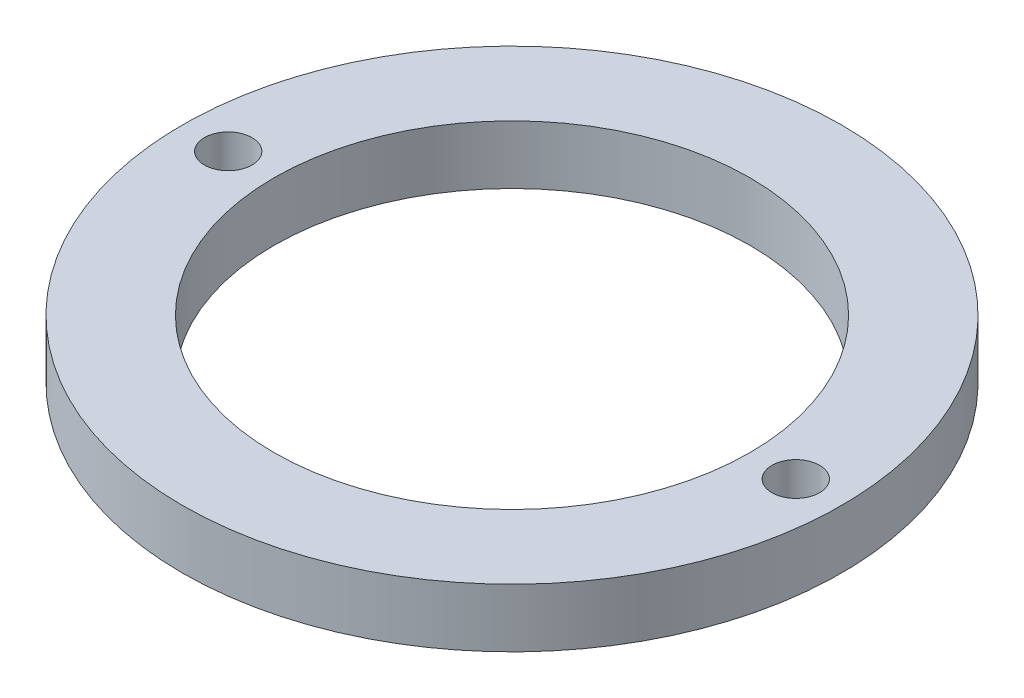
ISO-10303-21;
HEADER;
FILE_DESCRIPTION(('STEP AP214'),'2;1');
FILE_NAME('part.step','',(''),(''),'','','');
FILE_SCHEMA(('AUTOMOTIVE_DESIGN { 1 0 10303 214 1 1 1 1 }'));
ENDSEC;
DATA;
#1=APPLICATION_CONTEXT('core data for automotive mechanical design processes');
#2=APPLICATION_PROTOCOL_DEFINITION('international standard','automotive_design',2000,#1);
#3=PRODUCT_CONTEXT('',#1,'mechanical');
#4=PRODUCT('Part','Part','',(#3));
#5=PRODUCT_RELATED_PRODUCT_CATEGORY('part','',(#4));
#6=PRODUCT_DEFINITION_FORMATION('','',#4);
#7=PRODUCT_DEFINITION_CONTEXT('part definition',#1,'design');
#8=PRODUCT_DEFINITION('design','',#6,#7);
#9=PRODUCT_DEFINITION_SHAPE('','',#8);
#10=(LENGTH_UNIT() NAMED_UNIT(*) SI_UNIT(.MILLI.,.METRE.));
#11=(NAMED_UNIT(*) PLANE_ANGLE_UNIT() SI_UNIT($,.RADIAN.));
#12=(NAMED_UNIT(*) SI_UNIT($,.STERADIAN.) SOLID_ANGLE_UNIT());
#13=UNCERTAINTY_MEASURE_WITH_UNIT(LENGTH_MEASURE(1.E-05),#10,'distance_accuracy_value','');
#14=(GEOMETRIC_REPRESENTATION_CONTEXT(3) GLOBAL_UNCERTAINTY_ASSIGNED_CONTEXT((#13)) GLOBAL_UNIT_ASSIGNED_CONTEXT((#10,
#11,#12)) REPRESENTATION_CONTEXT('',''));
#15=CARTESIAN_POINT('',(0.,0.,0.));
#16=DIRECTION('',(0.,0.,1.));
#17=DIRECTION('',(1.,0.,0.));
#18=AXIS2_PLACEMENT_3D('',#15,#16,#17);
#19=CARTESIAN_POINT('',(0.,8.,0.));
#20=DIRECTION('',(0.,1.,0.));
#21=DIRECTION('',(0.,0.,1.));
#22=AXIS2_PLACEMENT_3D('',#19,#20,#21);
#23=PLANE('',#22);
#24=CARTESIAN_POINT('',(-38.75,8.,0.));
#25=DIRECTION('',(0.,1.,0.));
#26=DIRECTION('',(0.,0.,1.));
#27=AXIS2_PLACEMENT_3D('',#24,#25,#26);
#28=CIRCLE('',#27,3.25);
#29=CARTESIAN_POINT('',(-38.75,8.,3.25));
#30=VERTEX_POINT('',#29);
#31=EDGE_CURVE('E30',#30,#30,#28,.T.);
#32=ORIENTED_EDGE('',*,*,#31,.F.);
#33=EDGE_LOOP('',(#32));
#34=FACE_BOUND('',#33,.T.);
#35=CARTESIAN_POINT('',(0.,8.,0.));
#36=DIRECTION('',(0.,1.,0.));
#37=DIRECTION('',(0.,0.,1.));
#38=AXIS2_PLACEMENT_3D('',#35,#36,#37);
#39=CIRCLE('',#38,45.);
#40=CARTESIAN_POINT('',(0.,8.,45.));
#41=VERTEX_POINT('',#40);
#42=EDGE_CURVE('E9',#41,#41,#39,.T.);
#43=ORIENTED_EDGE('',*,*,#42,.T.);
#44=EDGE_LOOP('',(#43));
#45=FACE_BOUND('',#44,.T.);
#46=CARTESIAN_POINT('',(0.,8.,0.));
#47=DIRECTION('',(0.,1.,0.));
#48=DIRECTION('',(0.,0.,1.));
#49=AXIS2_PLACEMENT_3D('',#46,#47,#48);
#50=CIRCLE('',#49,32.5);
#51=CARTESIAN_POINT('',(0.,8.,32.5));
#52=VERTEX_POINT('',#51);
#53=EDGE_CURVE('E25',#52,#52,#50,.T.);
#54=ORIENTED_EDGE('',*,*,#53,.F.);
#55=EDGE_LOOP('',(#54));
#56=FACE_BOUND('',#55,.T.);
#57=CARTESIAN_POINT('',(38.75,8.,0.));
#58=DIRECTION('',(0.,1.,0.));
#59=DIRECTION('',(0.,0.,1.));
#60=AXIS2_PLACEMENT_3D('',#57,#58,#59);
#61=CIRCLE('',#60,3.25);
#62=CARTESIAN_POINT('',(38.75,8.,3.25));
#63=VERTEX_POINT('',#62);
#64=EDGE_CURVE('E36',#63,#63,#61,.T.);
#65=ORIENTED_EDGE('',*,*,#64,.F.);
#66=EDGE_LOOP('',(#65));
#67=FACE_BOUND('',#66,.T.);
#68=ADVANCED_FACE('F14',(#34,#45,#56,#67),#23,.T.);
#69=CARTESIAN_POINT('',(0.,0.,0.));
#70=DIRECTION('',(0.,1.,0.));
#71=DIRECTION('',(0.,0.,1.));
#72=AXIS2_PLACEMENT_3D('',#69,#70,#71);
#73=PLANE('',#72);
#74=CARTESIAN_POINT('',(0.,0.,0.));
#75=DIRECTION('',(0.,1.,0.));
#76=DIRECTION('',(0.,0.,1.));
#77=AXIS2_PLACEMENT_3D('',#74,#75,#76);
#78=CIRCLE('',#77,45.);
#79=CARTESIAN_POINT('',(0.,0.,45.));
#80=VERTEX_POINT('',#79);
#81=EDGE_CURVE('E18',#80,#80,#78,.T.);
#82=ORIENTED_EDGE('',*,*,#81,.F.);
#83=EDGE_LOOP('',(#82));
#84=FACE_BOUND('',#83,.T.);
#85=CARTESIAN_POINT('',(0.,0.,0.));
#86=DIRECTION('',(0.,1.,0.));
#87=DIRECTION('',(0.,0.,1.));
#88=AXIS2_PLACEMENT_3D('',#85,#86,#87);
#89=CIRCLE('',#88,32.5);
#90=CARTESIAN_POINT('',(0.,0.,32.5));
#91=VERTEX_POINT('',#90);
#92=EDGE_CURVE('E27',#91,#91,#89,.T.);
#93=ORIENTED_EDGE('',*,*,#92,.T.);
#94=EDGE_LOOP('',(#93));
#95=FACE_BOUND('',#94,.T.);
#96=CARTESIAN_POINT('',(-38.75,0.,0.));
#97=DIRECTION('',(0.,1.,0.));
#98=DIRECTION('',(0.,0.,1.));
#99=AXIS2_PLACEMENT_3D('',#96,#97,#98);
#100=CIRCLE('',#99,3.25);
#101=CARTESIAN_POINT('',(-38.75,0.,3.25));
#102=VERTEX_POINT('',#101);
#103=EDGE_CURVE('E33',#102,#102,#100,.T.);
#104=ORIENTED_EDGE('',*,*,#103,.T.);
#105=EDGE_LOOP('',(#104));
#106=FACE_BOUND('',#105,.T.);
#107=CARTESIAN_POINT('',(38.75,0.,0.));
#108=DIRECTION('',(0.,1.,0.));
#109=DIRECTION('',(0.,0.,1.));
#110=AXIS2_PLACEMENT_3D('',#107,#108,#109);
#111=CIRCLE('',#110,3.25);
#112=CARTESIAN_POINT('',(38.75,0.,3.25));
#113=VERTEX_POINT('',#112);
#114=EDGE_CURVE('E39',#113,#113,#111,.T.);
#115=ORIENTED_EDGE('',*,*,#114,.T.);
#116=EDGE_LOOP('',(#115));
#117=FACE_BOUND('',#116,.T.);
#118=ADVANCED_FACE('F49',(#84,#95,#106,#117),#73,.F.);
#119=CARTESIAN_POINT('',(0.,8.,0.));
#120=DIRECTION('',(0.,-1.,0.));
#121=DIRECTION('',(0.,0.,-1.));
#122=AXIS2_PLACEMENT_3D('',#119,#120,#121);
#123=CYLINDRICAL_SURFACE('',#122,45.);
#124=ORIENTED_EDGE('',*,*,#42,.F.);
#125=EDGE_LOOP('',(#124));
#126=FACE_BOUND('',#125,.T.);
#127=ORIENTED_EDGE('',*,*,#81,.T.);
#128=EDGE_LOOP('',(#127));
#129=FACE_BOUND('',#128,.T.);
#130=ADVANCED_FACE('F16',(#126,#129),#123,.T.);
#131=CARTESIAN_POINT('',(0.,8.,0.));
#132=DIRECTION('',(0.,-1.,0.));
#133=DIRECTION('',(0.,0.,-1.));
#134=AXIS2_PLACEMENT_3D('',#131,#132,#133);
#135=CYLINDRICAL_SURFACE('',#134,32.5);
#136=ORIENTED_EDGE('',*,*,#53,.T.);
#137=EDGE_LOOP('',(#136));
#138=FACE_BOUND('',#137,.T.);
#139=ORIENTED_EDGE('',*,*,#92,.F.);
#140=EDGE_LOOP('',(#139));
#141=FACE_BOUND('',#140,.T.);
#142=ADVANCED_FACE('F60',(#138,#141),#135,.F.);
#143=CARTESIAN_POINT('',(-38.75,8.,0.));
#144=DIRECTION('',(0.,-1.,0.));
#145=DIRECTION('',(0.,0.,-1.));
#146=AXIS2_PLACEMENT_3D('',#143,#144,#145);
#147=CYLINDRICAL_SURFACE('',#146,3.25);
#148=ORIENTED_EDGE('',*,*,#31,.T.);
#149=EDGE_LOOP('',(#148));
#150=FACE_BOUND('',#149,.T.);
#151=ORIENTED_EDGE('',*,*,#103,.F.);
#152=EDGE_LOOP('',(#151));
#153=FACE_BOUND('',#152,.T.);
#154=ADVANCED_FACE('F63',(#150,#153),#147,.F.);
#155=CARTESIAN_POINT('',(38.75,8.,0.));
#156=DIRECTION('',(0.,-1.,0.));
#157=DIRECTION('',(0.,0.,-1.));
#158=AXIS2_PLACEMENT_3D('',#155,#156,#157);
#159=CYLINDRICAL_SURFACE('',#158,3.25);
#160=ORIENTED_EDGE('',*,*,#64,.T.);
#161=EDGE_LOOP('',(#160));
#162=FACE_BOUND('',#161,.T.);
#163=ORIENTED_EDGE('',*,*,#114,.F.);
#164=EDGE_LOOP('',(#163));
#165=FACE_BOUND('',#164,.T.);
#166=ADVANCED_FACE('F45',(#162,#165),#159,.F.);
#167=CLOSED_SHELL('',(#68,#118,#130,#142,#154,#166));
#168=MANIFOLD_SOLID_BREP('B1',#167);
#169=ADVANCED_BREP_SHAPE_REPRESENTATION('',(#18,#168),#14);
#170=SHAPE_DEFINITION_REPRESENTATION(#9,#169);
ENDSEC;
END-ISO-10303-21;
